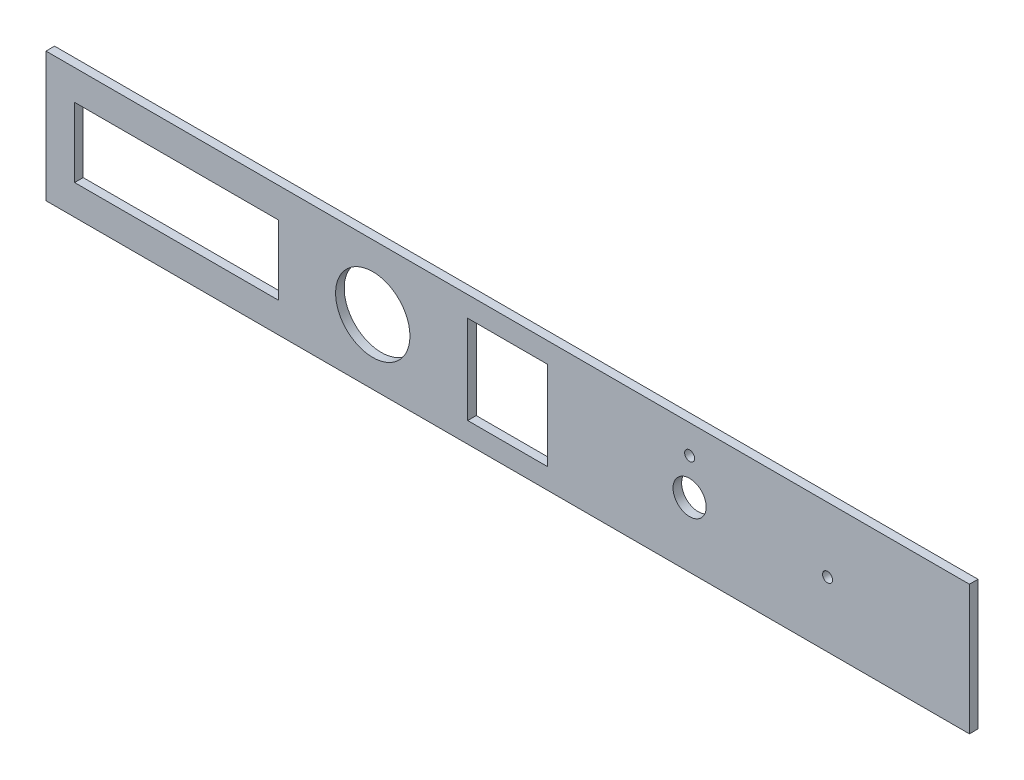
from build123d import *

# Parameters (mm, degrees)
SKETCH1_W               = 323
SKETCH1_H               = 45.34
BOSS_EXTRUDE1_DEPTH     = 3
CUT_EXTRUDE1_DEPTH      = 164.110940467
CUT_EXTRUDE1_DEPTH_BACK = 164.110940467
SKETCH2_R               = 13
SKETCH2_R_2             = 5.8
SKETCH2_R_3             = 1.75
SKETCH2_W               = 71.3
SKETCH2_H               = 24.3
SKETCH2_W_2             = 28
SKETCH2_H_2             = 31


with BuildPart() as part:
    # Sketch1 → Boss-Extrude1 (new body)
    with BuildSketch(Plane.XY):
        Rectangle(SKETCH1_W, SKETCH1_H)
    extrude(amount=BOSS_EXTRUDE1_DEPTH)

    # Sketch2 → Cut-Extrude1 (cut, two sides: drawn at the far end of the back side and taken through both)
    with BuildSketch(Plane.XY.offset(3).offset(-CUT_EXTRUDE1_DEPTH_BACK)):
        with Locations((-47.2, 0)):
            Circle(SKETCH2_R)
        with Locations((63.625, 0)):
            Circle(SKETCH2_R_2)
        with Locations((63.625, 12.67)):
            Circle(SKETCH2_R_3)
        with Locations((111.875, 0)):
            Circle(SKETCH2_R_3)
        with Locations((-115.85, 0)):
            Rectangle(SKETCH2_W, SKETCH2_H)
        Rectangle(SKETCH2_W_2, SKETCH2_H_2)
    extrude(amount=CUT_EXTRUDE1_DEPTH + CUT_EXTRUDE1_DEPTH_BACK, mode=Mode.SUBTRACT)


solid = part.part
